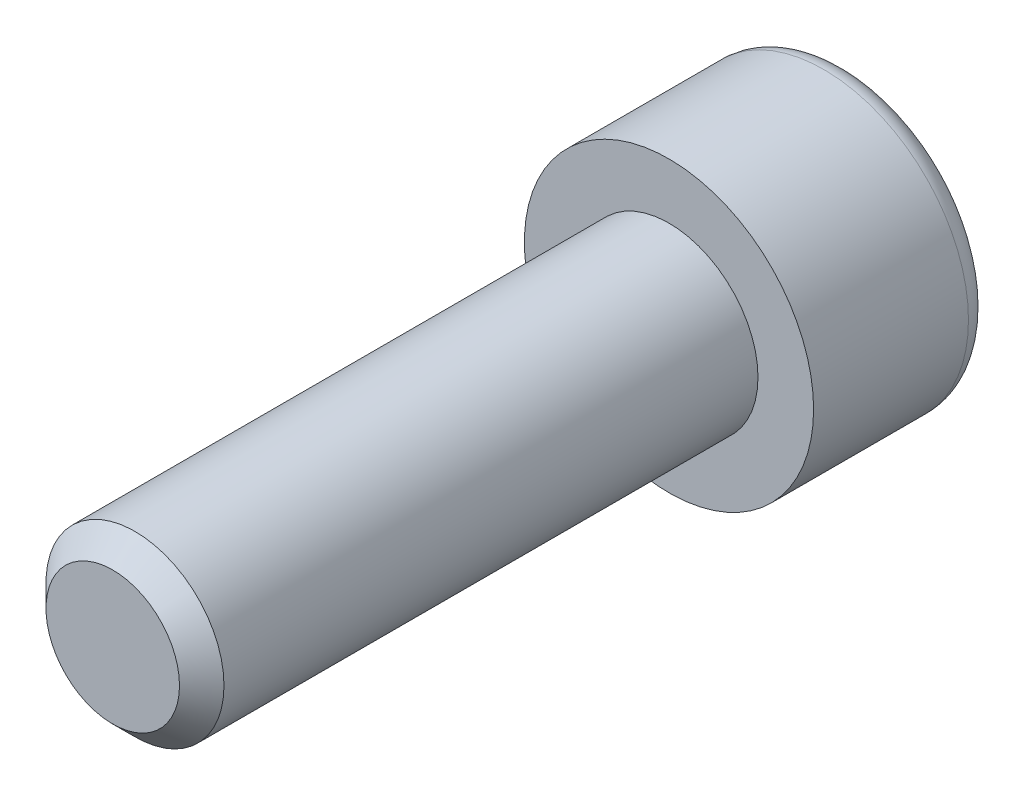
ISO-10303-21;
HEADER;
FILE_DESCRIPTION(('STEP AP214'),'2;1');
FILE_NAME('part.step','',(''),(''),'','','');
FILE_SCHEMA(('AUTOMOTIVE_DESIGN { 1 0 10303 214 1 1 1 1 }'));
ENDSEC;
DATA;
#1=APPLICATION_CONTEXT('core data for automotive mechanical design processes');
#2=APPLICATION_PROTOCOL_DEFINITION('international standard','automotive_design',2000,#1);
#3=PRODUCT_CONTEXT('',#1,'mechanical');
#4=PRODUCT('Part','Part','',(#3));
#5=PRODUCT_RELATED_PRODUCT_CATEGORY('part','',(#4));
#6=PRODUCT_DEFINITION_FORMATION('','',#4);
#7=PRODUCT_DEFINITION_CONTEXT('part definition',#1,'design');
#8=PRODUCT_DEFINITION('design','',#6,#7);
#9=PRODUCT_DEFINITION_SHAPE('','',#8);
#10=(LENGTH_UNIT() NAMED_UNIT(*) SI_UNIT(.MILLI.,.METRE.));
#11=(NAMED_UNIT(*) PLANE_ANGLE_UNIT() SI_UNIT($,.RADIAN.));
#12=(NAMED_UNIT(*) SI_UNIT($,.STERADIAN.) SOLID_ANGLE_UNIT());
#13=UNCERTAINTY_MEASURE_WITH_UNIT(LENGTH_MEASURE(1.E-05),#10,'distance_accuracy_value','');
#14=(GEOMETRIC_REPRESENTATION_CONTEXT(3) GLOBAL_UNCERTAINTY_ASSIGNED_CONTEXT((#13)) GLOBAL_UNIT_ASSIGNED_CONTEXT((#10,
#11,#12)) REPRESENTATION_CONTEXT('',''));
#15=CARTESIAN_POINT('',(0.,0.,0.));
#16=DIRECTION('',(0.,0.,1.));
#17=DIRECTION('',(1.,0.,0.));
#18=AXIS2_PLACEMENT_3D('',#15,#16,#17);
#19=CARTESIAN_POINT('',(0.,0.,-8.));
#20=DIRECTION('',(0.,0.,1.));
#21=DIRECTION('',(1.,0.,0.));
#22=AXIS2_PLACEMENT_3D('',#19,#20,#21);
#23=PLANE('',#22);
#24=CARTESIAN_POINT('',(0.,0.,-8.));
#25=DIRECTION('',(0.,0.,1.));
#26=DIRECTION('',(1.,0.,0.));
#27=AXIS2_PLACEMENT_3D('',#24,#25,#26);
#28=CIRCLE('',#27,5.46);
#29=CARTESIAN_POINT('',(5.46,0.,-8.));
#30=VERTEX_POINT('',#29);
#31=EDGE_CURVE('E11',#30,#30,#28,.F.);
#32=ORIENTED_EDGE('',*,*,#31,.T.);
#33=EDGE_LOOP('',(#32));
#34=FACE_BOUND('',#33,.T.);
#35=DIRECTION('',(0.866025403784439,-0.5,0.));
#36=VECTOR('',#35,1.);
#37=CARTESIAN_POINT('',(-3.,-1.73205080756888,-8.));
#38=LINE('',#37,#36);
#39=CARTESIAN_POINT('',(-3.,-1.73205080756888,-8.));
#40=VERTEX_POINT('',#39);
#41=CARTESIAN_POINT('',(0.,-3.46410161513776,-8.));
#42=VERTEX_POINT('',#41);
#43=EDGE_CURVE('E54',#40,#42,#38,.T.);
#44=ORIENTED_EDGE('',*,*,#43,.T.);
#45=DIRECTION('',(0.866025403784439,0.5,0.));
#46=VECTOR('',#45,1.);
#47=CARTESIAN_POINT('',(0.,-3.46410161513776,-8.));
#48=LINE('',#47,#46);
#49=CARTESIAN_POINT('',(3.,-1.73205080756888,-8.));
#50=VERTEX_POINT('',#49);
#51=EDGE_CURVE('E125',#42,#50,#48,.T.);
#52=ORIENTED_EDGE('',*,*,#51,.T.);
#53=DIRECTION('',(0.,1.,0.));
#54=VECTOR('',#53,1.);
#55=CARTESIAN_POINT('',(3.,-1.73205080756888,-8.));
#56=LINE('',#55,#54);
#57=CARTESIAN_POINT('',(3.,1.73205080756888,-8.));
#58=VERTEX_POINT('',#57);
#59=EDGE_CURVE('E128',#50,#58,#56,.T.);
#60=ORIENTED_EDGE('',*,*,#59,.T.);
#61=DIRECTION('',(-0.866025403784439,0.5,0.));
#62=VECTOR('',#61,1.);
#63=CARTESIAN_POINT('',(3.,1.73205080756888,-8.));
#64=LINE('',#63,#62);
#65=CARTESIAN_POINT('',(0.,3.46410161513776,-8.));
#66=VERTEX_POINT('',#65);
#67=EDGE_CURVE('E131',#58,#66,#64,.T.);
#68=ORIENTED_EDGE('',*,*,#67,.T.);
#69=DIRECTION('',(-0.866025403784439,-0.5,0.));
#70=VECTOR('',#69,1.);
#71=CARTESIAN_POINT('',(0.,3.46410161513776,-8.));
#72=LINE('',#71,#70);
#73=CARTESIAN_POINT('',(-3.,1.73205080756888,-8.));
#74=VERTEX_POINT('',#73);
#75=EDGE_CURVE('E115',#66,#74,#72,.T.);
#76=ORIENTED_EDGE('',*,*,#75,.T.);
#77=DIRECTION('',(0.,-1.,0.));
#78=VECTOR('',#77,1.);
#79=CARTESIAN_POINT('',(-3.,1.73205080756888,-8.));
#80=LINE('',#79,#78);
#81=EDGE_CURVE('E134',#74,#40,#80,.T.);
#82=ORIENTED_EDGE('',*,*,#81,.T.);
#83=EDGE_LOOP('',(#44,#52,#60,#68,#76,#82));
#84=FACE_BOUND('',#83,.T.);
#85=ADVANCED_FACE('F39',(#34,#84),#23,.F.);
#86=CARTESIAN_POINT('',(0.,0.,25.));
#87=DIRECTION('',(0.,0.,-1.));
#88=DIRECTION('',(-1.,0.,0.));
#89=AXIS2_PLACEMENT_3D('',#86,#87,#88);
#90=CYLINDRICAL_SURFACE('',#89,4.);
#91=CARTESIAN_POINT('',(0.,0.,24.));
#92=DIRECTION('',(0.,0.,1.));
#93=DIRECTION('',(1.,0.,0.));
#94=AXIS2_PLACEMENT_3D('',#91,#92,#93);
#95=CIRCLE('',#94,4.);
#96=CARTESIAN_POINT('',(4.,0.,24.));
#97=VERTEX_POINT('',#96);
#98=EDGE_CURVE('E154',#97,#97,#95,.F.);
#99=ORIENTED_EDGE('',*,*,#98,.T.);
#100=EDGE_LOOP('',(#99));
#101=FACE_BOUND('',#100,.T.);
#102=CARTESIAN_POINT('',(0.,0.,0.));
#103=DIRECTION('',(0.,0.,1.));
#104=DIRECTION('',(1.,0.,0.));
#105=AXIS2_PLACEMENT_3D('',#102,#103,#104);
#106=CIRCLE('',#105,4.);
#107=CARTESIAN_POINT('',(4.,0.,0.));
#108=VERTEX_POINT('',#107);
#109=EDGE_CURVE('E148',#108,#108,#106,.T.);
#110=ORIENTED_EDGE('',*,*,#109,.T.);
#111=EDGE_LOOP('',(#110));
#112=FACE_BOUND('',#111,.T.);
#113=ADVANCED_FACE('F171',(#101,#112),#90,.T.);
#114=CARTESIAN_POINT('',(0.,0.,25.));
#115=DIRECTION('',(0.,0.,1.));
#116=DIRECTION('',(1.,0.,0.));
#117=AXIS2_PLACEMENT_3D('',#114,#115,#116);
#118=PLANE('',#117);
#119=CARTESIAN_POINT('',(0.,0.,25.));
#120=DIRECTION('',(0.,0.,1.));
#121=DIRECTION('',(1.,0.,0.));
#122=AXIS2_PLACEMENT_3D('',#119,#120,#121);
#123=CIRCLE('',#122,3.);
#124=CARTESIAN_POINT('',(3.,0.,25.));
#125=VERTEX_POINT('',#124);
#126=EDGE_CURVE('E151',#125,#125,#123,.T.);
#127=ORIENTED_EDGE('',*,*,#126,.T.);
#128=EDGE_LOOP('',(#127));
#129=FACE_BOUND('',#128,.T.);
#130=ADVANCED_FACE('F177',(#129),#118,.T.);
#131=CARTESIAN_POINT('',(0.,0.,0.));
#132=DIRECTION('',(0.,0.,1.));
#133=DIRECTION('',(1.,0.,0.));
#134=AXIS2_PLACEMENT_3D('',#131,#132,#133);
#135=PLANE('',#134);
#136=CARTESIAN_POINT('',(0.,0.,0.));
#137=DIRECTION('',(0.,0.,1.));
#138=DIRECTION('',(1.,0.,0.));
#139=AXIS2_PLACEMENT_3D('',#136,#137,#138);
#140=CIRCLE('',#139,6.5);
#141=CARTESIAN_POINT('',(6.5,0.,0.));
#142=VERTEX_POINT('',#141);
#143=EDGE_CURVE('E145',#142,#142,#140,.T.);
#144=ORIENTED_EDGE('',*,*,#143,.T.);
#145=EDGE_LOOP('',(#144));
#146=FACE_BOUND('',#145,.T.);
#147=ORIENTED_EDGE('',*,*,#109,.F.);
#148=EDGE_LOOP('',(#147));
#149=FACE_BOUND('',#148,.T.);
#150=ADVANCED_FACE('F185',(#146,#149),#135,.T.);
#151=CARTESIAN_POINT('',(0.,0.,-8.));
#152=DIRECTION('',(0.,0.,1.));
#153=DIRECTION('',(1.,0.,0.));
#154=AXIS2_PLACEMENT_3D('',#151,#152,#153);
#155=CYLINDRICAL_SURFACE('',#154,6.5);
#156=CARTESIAN_POINT('',(0.,0.,-6.96));
#157=DIRECTION('',(0.,0.,1.));
#158=DIRECTION('',(1.,0.,0.));
#159=AXIS2_PLACEMENT_3D('',#156,#157,#158);
#160=CIRCLE('',#159,6.5);
#161=CARTESIAN_POINT('',(6.5,0.,-6.96));
#162=VERTEX_POINT('',#161);
#163=EDGE_CURVE('E47',#162,#162,#160,.T.);
#164=ORIENTED_EDGE('',*,*,#163,.T.);
#165=EDGE_LOOP('',(#164));
#166=FACE_BOUND('',#165,.T.);
#167=ORIENTED_EDGE('',*,*,#143,.F.);
#168=EDGE_LOOP('',(#167));
#169=FACE_BOUND('',#168,.T.);
#170=ADVANCED_FACE('F159',(#166,#169),#155,.T.);
#171=CARTESIAN_POINT('',(-3.,-1.73205080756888,-2.4));
#172=DIRECTION('',(0.5,0.866025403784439,0.));
#173=DIRECTION('',(-0.866025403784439,0.5,0.));
#174=AXIS2_PLACEMENT_3D('',#171,#172,#173);
#175=PLANE('',#174);
#176=ORIENTED_EDGE('',*,*,#43,.F.);
#177=DIRECTION('',(0.,0.,-1.));
#178=VECTOR('',#177,1.);
#179=CARTESIAN_POINT('',(-3.,-1.73205080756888,-2.4));
#180=LINE('',#179,#178);
#181=CARTESIAN_POINT('',(-3.,-1.73205080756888,-2.4));
#182=VERTEX_POINT('',#181);
#183=EDGE_CURVE('E120',#182,#40,#180,.T.);
#184=ORIENTED_EDGE('',*,*,#183,.F.);
#185=DIRECTION('',(0.866025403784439,-0.5,0.));
#186=VECTOR('',#185,1.);
#187=CARTESIAN_POINT('',(-3.,-1.73205080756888,-2.4));
#188=LINE('',#187,#186);
#189=CARTESIAN_POINT('',(0.,-3.46410161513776,-2.4));
#190=VERTEX_POINT('',#189);
#191=EDGE_CURVE('E137',#182,#190,#188,.T.);
#192=ORIENTED_EDGE('',*,*,#191,.T.);
#193=DIRECTION('',(0.,0.,-1.));
#194=VECTOR('',#193,1.);
#195=CARTESIAN_POINT('',(0.,-3.46410161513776,-2.4));
#196=LINE('',#195,#194);
#197=EDGE_CURVE('E143',#190,#42,#196,.T.);
#198=ORIENTED_EDGE('',*,*,#197,.T.);
#199=EDGE_LOOP('',(#176,#184,#192,#198));
#200=FACE_BOUND('',#199,.T.);
#201=ADVANCED_FACE('F183',(#200),#175,.T.);
#202=CARTESIAN_POINT('',(0.,-3.46410161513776,-2.4));
#203=DIRECTION('',(-0.5,0.866025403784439,0.));
#204=DIRECTION('',(-0.866025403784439,-0.5,0.));
#205=AXIS2_PLACEMENT_3D('',#202,#203,#204);
#206=PLANE('',#205);
#207=ORIENTED_EDGE('',*,*,#51,.F.);
#208=ORIENTED_EDGE('',*,*,#197,.F.);
#209=DIRECTION('',(0.866025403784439,0.5,0.));
#210=VECTOR('',#209,1.);
#211=CARTESIAN_POINT('',(0.,-3.46410161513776,-2.4));
#212=LINE('',#211,#210);
#213=CARTESIAN_POINT('',(3.,-1.73205080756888,-2.4));
#214=VERTEX_POINT('',#213);
#215=EDGE_CURVE('E93',#190,#214,#212,.T.);
#216=ORIENTED_EDGE('',*,*,#215,.T.);
#217=DIRECTION('',(0.,0.,-1.));
#218=VECTOR('',#217,1.);
#219=CARTESIAN_POINT('',(3.,-1.73205080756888,-2.4));
#220=LINE('',#219,#218);
#221=EDGE_CURVE('E141',#214,#50,#220,.T.);
#222=ORIENTED_EDGE('',*,*,#221,.T.);
#223=EDGE_LOOP('',(#207,#208,#216,#222));
#224=FACE_BOUND('',#223,.T.);
#225=ADVANCED_FACE('F215',(#224),#206,.T.);
#226=CARTESIAN_POINT('',(3.,-1.73205080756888,-2.4));
#227=DIRECTION('',(-1.,0.,0.));
#228=DIRECTION('',(0.,-1.,0.));
#229=AXIS2_PLACEMENT_3D('',#226,#227,#228);
#230=PLANE('',#229);
#231=ORIENTED_EDGE('',*,*,#59,.F.);
#232=ORIENTED_EDGE('',*,*,#221,.F.);
#233=DIRECTION('',(0.,1.,0.));
#234=VECTOR('',#233,1.);
#235=CARTESIAN_POINT('',(3.,-1.73205080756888,-2.4));
#236=LINE('',#235,#234);
#237=CARTESIAN_POINT('',(3.,1.73205080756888,-2.4));
#238=VERTEX_POINT('',#237);
#239=EDGE_CURVE('E111',#214,#238,#236,.T.);
#240=ORIENTED_EDGE('',*,*,#239,.T.);
#241=DIRECTION('',(0.,0.,-1.));
#242=VECTOR('',#241,1.);
#243=CARTESIAN_POINT('',(3.,1.73205080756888,-2.4));
#244=LINE('',#243,#242);
#245=EDGE_CURVE('E108',#238,#58,#244,.T.);
#246=ORIENTED_EDGE('',*,*,#245,.T.);
#247=EDGE_LOOP('',(#231,#232,#240,#246));
#248=FACE_BOUND('',#247,.T.);
#249=ADVANCED_FACE('F221',(#248),#230,.T.);
#250=CARTESIAN_POINT('',(3.,1.73205080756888,-2.4));
#251=DIRECTION('',(-0.5,-0.866025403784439,0.));
#252=DIRECTION('',(0.866025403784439,-0.5,0.));
#253=AXIS2_PLACEMENT_3D('',#250,#251,#252);
#254=PLANE('',#253);
#255=ORIENTED_EDGE('',*,*,#67,.F.);
#256=ORIENTED_EDGE('',*,*,#245,.F.);
#257=DIRECTION('',(-0.866025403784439,0.5,0.));
#258=VECTOR('',#257,1.);
#259=CARTESIAN_POINT('',(3.,1.73205080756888,-2.4));
#260=LINE('',#259,#258);
#261=CARTESIAN_POINT('',(0.,3.46410161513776,-2.4));
#262=VERTEX_POINT('',#261);
#263=EDGE_CURVE('E103',#238,#262,#260,.T.);
#264=ORIENTED_EDGE('',*,*,#263,.T.);
#265=DIRECTION('',(0.,0.,-1.));
#266=VECTOR('',#265,1.);
#267=CARTESIAN_POINT('',(0.,3.46410161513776,-2.4));
#268=LINE('',#267,#266);
#269=EDGE_CURVE('E107',#262,#66,#268,.T.);
#270=ORIENTED_EDGE('',*,*,#269,.T.);
#271=EDGE_LOOP('',(#255,#256,#264,#270));
#272=FACE_BOUND('',#271,.T.);
#273=ADVANCED_FACE('F106',(#272),#254,.T.);
#274=CARTESIAN_POINT('',(0.,3.46410161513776,-2.4));
#275=DIRECTION('',(0.5,-0.866025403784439,0.));
#276=DIRECTION('',(0.866025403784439,0.5,0.));
#277=AXIS2_PLACEMENT_3D('',#274,#275,#276);
#278=PLANE('',#277);
#279=ORIENTED_EDGE('',*,*,#75,.F.);
#280=ORIENTED_EDGE('',*,*,#269,.F.);
#281=DIRECTION('',(-0.866025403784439,-0.5,0.));
#282=VECTOR('',#281,1.);
#283=CARTESIAN_POINT('',(0.,3.46410161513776,-2.4));
#284=LINE('',#283,#282);
#285=CARTESIAN_POINT('',(-3.,1.73205080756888,-2.4));
#286=VERTEX_POINT('',#285);
#287=EDGE_CURVE('E110',#262,#286,#284,.T.);
#288=ORIENTED_EDGE('',*,*,#287,.T.);
#289=DIRECTION('',(0.,0.,-1.));
#290=VECTOR('',#289,1.);
#291=CARTESIAN_POINT('',(-3.,1.73205080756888,-2.4));
#292=LINE('',#291,#290);
#293=EDGE_CURVE('E84',#286,#74,#292,.T.);
#294=ORIENTED_EDGE('',*,*,#293,.T.);
#295=EDGE_LOOP('',(#279,#280,#288,#294));
#296=FACE_BOUND('',#295,.T.);
#297=ADVANCED_FACE('F113',(#296),#278,.T.);
#298=CARTESIAN_POINT('',(-3.,1.73205080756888,-2.4));
#299=DIRECTION('',(1.,0.,0.));
#300=DIRECTION('',(0.,1.,0.));
#301=AXIS2_PLACEMENT_3D('',#298,#299,#300);
#302=PLANE('',#301);
#303=ORIENTED_EDGE('',*,*,#81,.F.);
#304=ORIENTED_EDGE('',*,*,#293,.F.);
#305=DIRECTION('',(0.,-1.,0.));
#306=VECTOR('',#305,1.);
#307=CARTESIAN_POINT('',(-3.,1.73205080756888,-2.4));
#308=LINE('',#307,#306);
#309=EDGE_CURVE('E62',#286,#182,#308,.T.);
#310=ORIENTED_EDGE('',*,*,#309,.T.);
#311=ORIENTED_EDGE('',*,*,#183,.T.);
#312=EDGE_LOOP('',(#303,#304,#310,#311));
#313=FACE_BOUND('',#312,.T.);
#314=ADVANCED_FACE('F241',(#313),#302,.T.);
#315=CARTESIAN_POINT('',(-6.,0.,-2.4));
#316=DIRECTION('',(0.,0.,-1.));
#317=DIRECTION('',(-1.,0.,0.));
#318=AXIS2_PLACEMENT_3D('',#315,#316,#317);
#319=PLANE('',#318);
#320=ORIENTED_EDGE('',*,*,#191,.F.);
#321=ORIENTED_EDGE('',*,*,#309,.F.);
#322=ORIENTED_EDGE('',*,*,#287,.F.);
#323=ORIENTED_EDGE('',*,*,#263,.F.);
#324=ORIENTED_EDGE('',*,*,#239,.F.);
#325=ORIENTED_EDGE('',*,*,#215,.F.);
#326=EDGE_LOOP('',(#320,#321,#322,#323,#324,#325));
#327=FACE_BOUND('',#326,.T.);
#328=ADVANCED_FACE('F118',(#327),#319,.T.);
#329=CARTESIAN_POINT('',(0.,0.,25.));
#330=DIRECTION('',(0.,0.,-1.));
#331=DIRECTION('',(-1.,0.,0.));
#332=AXIS2_PLACEMENT_3D('',#329,#330,#331);
#333=CONICAL_SURFACE('',#332,3.,0.785398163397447);
#334=ORIENTED_EDGE('',*,*,#98,.F.);
#335=EDGE_LOOP('',(#334));
#336=FACE_BOUND('',#335,.T.);
#337=ORIENTED_EDGE('',*,*,#126,.F.);
#338=EDGE_LOOP('',(#337));
#339=FACE_BOUND('',#338,.T.);
#340=ADVANCED_FACE('F163',(#336,#339),#333,.T.);
#341=CARTESIAN_POINT('',(0.,0.,-6.96));
#342=DIRECTION('',(0.,0.,1.));
#343=DIRECTION('',(1.,0.,0.));
#344=AXIS2_PLACEMENT_3D('',#341,#342,#343);
#345=TOROIDAL_SURFACE('',#344,5.46,1.04);
#346=ORIENTED_EDGE('',*,*,#31,.F.);
#347=EDGE_LOOP('',(#346));
#348=FACE_BOUND('',#347,.T.);
#349=ORIENTED_EDGE('',*,*,#163,.F.);
#350=EDGE_LOOP('',(#349));
#351=FACE_BOUND('',#350,.T.);
#352=ADVANCED_FACE('F41',(#348,#351),#345,.T.);
#353=CLOSED_SHELL('',(#85,#113,#130,#150,#170,#201,#225,#249,#273,#297,#314,#328,#340,#352));
#354=MANIFOLD_SOLID_BREP('B2',#353);
#355=ADVANCED_BREP_SHAPE_REPRESENTATION('',(#18,#354),#14);
#356=SHAPE_DEFINITION_REPRESENTATION(#9,#355);
ENDSEC;
END-ISO-10303-21;
